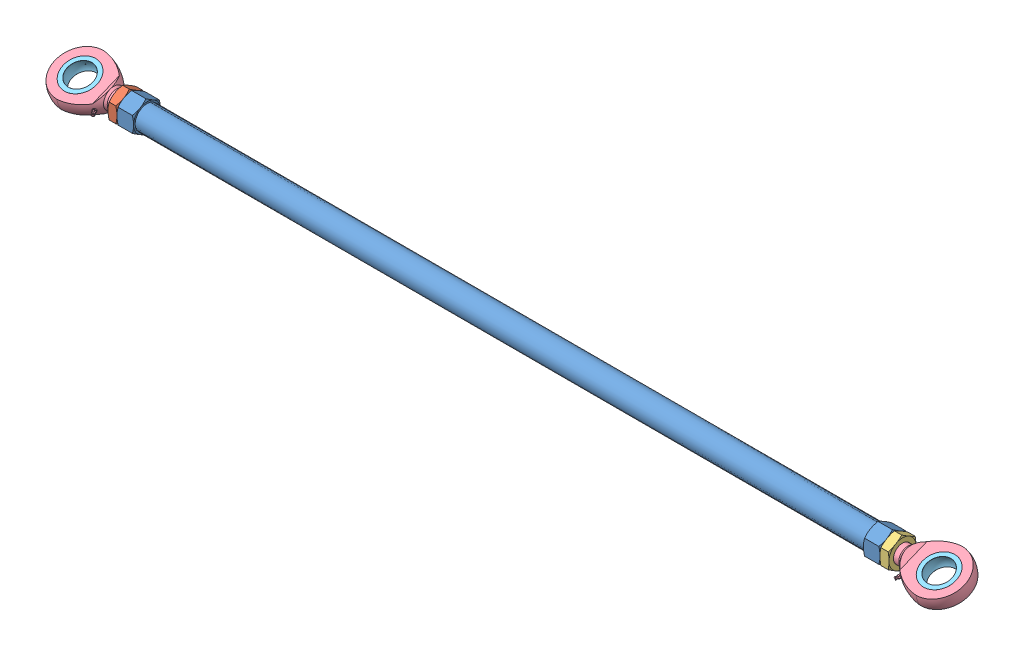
SolidWorks assembly TIRANT.sldasm, configuration Défaut (file format 11000). Lengths in mm.
Overall size (811.1 39.05 54.54).
7 component instances, 5 part files, 4 mates.
Components (placement in the parent):
- Tige Tirant-1: Tige Tirant.sldprt [Défaut] at origin size (679.6 27.71 24)
- Ecrou bas Hm M16-1: Ecrou bas Hm M16.sldprt [Défaut] at (-347.8 0 0) x (0 0 1) z (-1 0 0) size (24 27.71 8)
- Ecrou bas Hm M16 pas gauche-1: Ecrou bas Hm M16 pas gauche.sldprt [Défaut] at (339.8 0 0) x (0 -0.5 -0.866025) z (1 0 0) size (27.72 24.01 8.05)
- Fixation Tirant_1-1: Fixation Tirant_1.sldprt [Défaut] at (313.55 0 0) x (1 0 0) z (0 -0.924225 -0.381849) size (92.83 50.11 21.55)
- Fixation Tirant_2-1: Fixation Tirant_2.sldprt [Défaut] at (420.2829 22.059 -53.3913) x (-0.546853 -0.319695 0.773787) z (0 -0.924225 -0.381849) size (30 30 11)
- Fixation Tirant_1-2: Fixation Tirant_1.sldprt [Défaut] at (-313.55 0 0) x (-1 0 0) z (0 0.924225 0.381849) size (92.83 50.11 21.55)
- Fixation Tirant_2-2: Fixation Tirant_2.sldprt [Défaut] at (-420.2829 22.059 -53.3913) x (0.546853 -0.319695 0.773787) z (0 0.924225 0.381849) size (30 30 11)
Mates (geometry in assembly coordinates):
- Coaxiale5: concentric: cylinder of Ecrou bas Hm M16 pas gauche-1 through (343.8 0 0) axis (1 0 0) radius 6.9175; cylinder of Fixation Tirant_1-1 through (333.6251 0 0) axis (-1 0 0) radius 8
- Distance3: distance = 34.75 mm: point of Fixation Tirant_1-1; plane of Ecrou bas Hm M16 pas gauche-1 through (347.8 0 0) normal (1 0 0)
- Coaxiale6: concentric: cylinder of Ecrou bas Hm M16-1 through (-339.8 0 0) axis (-1 0 0) radius 7; cylinder of Fixation Tirant_1-2 through (-333.6251 0 0) axis (1 0 0) radius 8
- Distance4: distance = 34.75 mm: point of Fixation Tirant_1-2; plane of Ecrou bas Hm M16-1 through (-347.8 13.8564 0) normal (-1 0 0)
